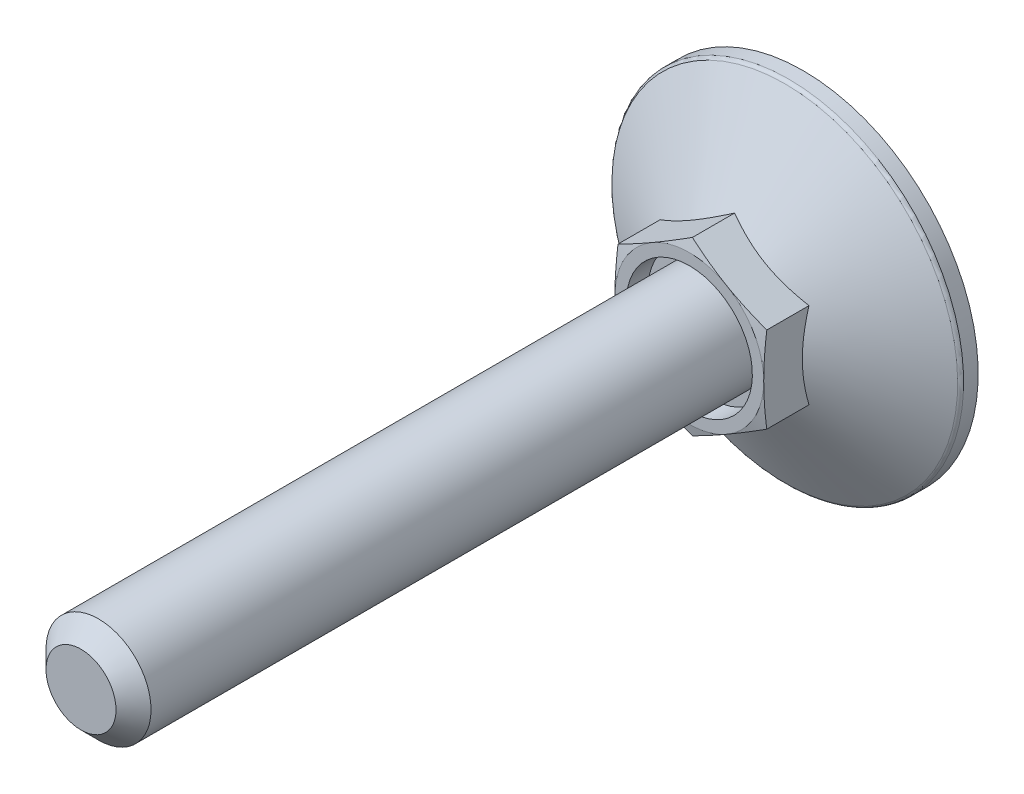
ISO-10303-21;
HEADER;
FILE_DESCRIPTION(('STEP AP214'),'2;1');
FILE_NAME('part.step','',(''),(''),'','','');
FILE_SCHEMA(('AUTOMOTIVE_DESIGN { 1 0 10303 214 1 1 1 1 }'));
ENDSEC;
DATA;
#1=APPLICATION_CONTEXT('core data for automotive mechanical design processes');
#2=APPLICATION_PROTOCOL_DEFINITION('international standard','automotive_design',2000,#1);
#3=PRODUCT_CONTEXT('',#1,'mechanical');
#4=PRODUCT('Part','Part','',(#3));
#5=PRODUCT_RELATED_PRODUCT_CATEGORY('part','',(#4));
#6=PRODUCT_DEFINITION_FORMATION('','',#4);
#7=PRODUCT_DEFINITION_CONTEXT('part definition',#1,'design');
#8=PRODUCT_DEFINITION('design','',#6,#7);
#9=PRODUCT_DEFINITION_SHAPE('','',#8);
#10=(LENGTH_UNIT() NAMED_UNIT(*) SI_UNIT(.MILLI.,.METRE.));
#11=(NAMED_UNIT(*) PLANE_ANGLE_UNIT() SI_UNIT($,.RADIAN.));
#12=(NAMED_UNIT(*) SI_UNIT($,.STERADIAN.) SOLID_ANGLE_UNIT());
#13=UNCERTAINTY_MEASURE_WITH_UNIT(LENGTH_MEASURE(1.E-05),#10,'distance_accuracy_value','');
#14=(GEOMETRIC_REPRESENTATION_CONTEXT(3) GLOBAL_UNCERTAINTY_ASSIGNED_CONTEXT((#13)) GLOBAL_UNIT_ASSIGNED_CONTEXT((#10,
#11,#12)) REPRESENTATION_CONTEXT('',''));
#15=CARTESIAN_POINT('',(0.,0.,0.));
#16=DIRECTION('',(0.,0.,1.));
#17=DIRECTION('',(1.,0.,0.));
#18=AXIS2_PLACEMENT_3D('',#15,#16,#17);
#19=CARTESIAN_POINT('',(0.,0.,10.525));
#20=DIRECTION('',(0.,0.,-1.));
#21=DIRECTION('',(0.,1.,0.));
#22=AXIS2_PLACEMENT_3D('',#19,#20,#21);
#23=PLANE('',#22);
#24=CARTESIAN_POINT('',(0.,0.,10.525));
#25=DIRECTION('',(0.,0.,-1.));
#26=DIRECTION('',(0.,1.,0.));
#27=AXIS2_PLACEMENT_3D('',#24,#25,#26);
#28=CIRCLE('',#27,7.2);
#29=CARTESIAN_POINT('',(0.,7.2,10.525));
#30=VERTEX_POINT('',#29);
#31=EDGE_CURVE('E108',#30,#30,#28,.T.);
#32=ORIENTED_EDGE('',*,*,#31,.F.);
#33=EDGE_LOOP('',(#32));
#34=FACE_BOUND('',#33,.T.);
#35=CARTESIAN_POINT('',(0.,0.,10.525));
#36=DIRECTION('',(0.,0.,-1.));
#37=DIRECTION('',(0.,1.,0.));
#38=AXIS2_PLACEMENT_3D('',#35,#36,#37);
#39=CIRCLE('',#38,6.);
#40=CARTESIAN_POINT('',(0.,6.,10.525));
#41=VERTEX_POINT('',#40);
#42=EDGE_CURVE('E260',#41,#41,#39,.F.);
#43=ORIENTED_EDGE('',*,*,#42,.F.);
#44=EDGE_LOOP('',(#43));
#45=FACE_BOUND('',#44,.T.);
#46=ADVANCED_FACE('F14',(#34,#45),#23,.F.);
#47=CARTESIAN_POINT('',(0.,9.81495457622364,99.));
#48=DIRECTION('',(0.5,-0.866025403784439,0.));
#49=DIRECTION('',(0.866025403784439,0.5,0.));
#50=AXIS2_PLACEMENT_3D('',#47,#48,#49);
#51=PLANE('',#50);
#52=CARTESIAN_POINT('',(-8.5002,4.90736181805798,7.83027204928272));
#53=CARTESIAN_POINT('',(-8.31336077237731,5.01523349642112,7.89254195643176));
#54=CARTESIAN_POINT('',(-8.1258249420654,5.1235073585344,7.95198579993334));
#55=CARTESIAN_POINT('',(-7.74923024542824,5.34093440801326,8.06444298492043));
#56=CARTESIAN_POINT('',(-7.56017075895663,5.45008795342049,8.1174535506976));
#57=CARTESIAN_POINT('',(-6.9899652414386,5.77929626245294,8.26579470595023));
#58=CARTESIAN_POINT('',(-6.60656835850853,6.00065055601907,8.3501691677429));
#59=CARTESIAN_POINT('',(-6.03282233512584,6.33190297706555,8.44910807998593));
#60=CARTESIAN_POINT('',(-5.84418723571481,6.44081150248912,8.47729289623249));
#61=CARTESIAN_POINT('',(-5.46606397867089,6.65912106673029,8.52455401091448));
#62=CARTESIAN_POINT('',(-5.27657589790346,6.76852206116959,8.54363111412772));
#63=CARTESIAN_POINT('',(-4.8972734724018,6.98751241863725,8.57219332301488));
#64=CARTESIAN_POINT('',(-4.7074597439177,7.09710142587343,8.58168931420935));
#65=CARTESIAN_POINT('',(-4.32765694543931,7.3163806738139,8.59088571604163));
#66=CARTESIAN_POINT('',(-4.13766788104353,7.42607091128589,8.59058642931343));
#67=CARTESIAN_POINT('',(-3.78247698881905,7.63114046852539,8.58087362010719));
#68=CARTESIAN_POINT('',(-3.6172500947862,7.72653426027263,8.57264492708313));
#69=CARTESIAN_POINT('',(-3.28718328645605,7.9170984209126,8.54893885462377));
#70=CARTESIAN_POINT('',(-3.12234339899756,8.01226877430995,8.53346098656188));
#71=CARTESIAN_POINT('',(-2.62846189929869,8.29741139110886,8.47651947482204));
#72=CARTESIAN_POINT('',(-2.30029449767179,8.48687892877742,8.42455503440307));
#73=CARTESIAN_POINT('',(-1.64047857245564,8.86782383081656,8.29464315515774));
#74=CARTESIAN_POINT('',(-1.30891425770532,9.05925257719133,8.21614502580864));
#75=CARTESIAN_POINT('',(-0.650730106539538,9.43925537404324,8.03798675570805));
#76=CARTESIAN_POINT('',(-0.324101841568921,9.62783429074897,7.93836845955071));
#77=CARTESIAN_POINT('',(0.000199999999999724,9.81507004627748,7.83027204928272));
#78=B_SPLINE_CURVE_WITH_KNOTS('',3,(#52,#53,#54,#55,#56,#57,#58,#59,#60,#61,#62,#63,#64,#65,#66,
#67,#68,#69,#70,#71,#72,#73,#74,#75,#76,#77),.UNSPECIFIED.,.F.,.F.,(4,2,2,2,2,2,2,2,2,2,2,2,4),
(0.,0.673596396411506,1.34748239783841,2.69805431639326,3.356799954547,4.01548737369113,
4.67342558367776,5.33134346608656,5.90409556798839,6.47688628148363,7.62328361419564,
8.79510569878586,9.9646274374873),.UNSPECIFIED.);
#79=CARTESIAN_POINT('',(-8.5,4.90747728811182,7.83033871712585));
#80=VERTEX_POINT('',#79);
#81=CARTESIAN_POINT('',(0.,9.81495457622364,7.83033871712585));
#82=VERTEX_POINT('',#81);
#83=EDGE_CURVE('E97',#80,#82,#78,.T.);
#84=ORIENTED_EDGE('',*,*,#83,.F.);
#85=DIRECTION('',(0.,0.,-1.));
#86=VECTOR('',#85,1.);
#87=CARTESIAN_POINT('',(-8.5,4.90747728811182,99.));
#88=LINE('',#87,#86);
#89=CARTESIAN_POINT('',(-8.5,4.90747728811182,12.6476589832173));
#90=VERTEX_POINT('',#89);
#91=EDGE_CURVE('E86',#90,#80,#88,.T.);
#92=ORIENTED_EDGE('',*,*,#91,.F.);
#93=CARTESIAN_POINT('',(0.000200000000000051,9.81507004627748,12.6476280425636));
#94=CARTESIAN_POINT('',(-0.352800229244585,9.61126526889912,12.7022599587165));
#95=CARTESIAN_POINT('',(-0.706440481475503,9.40709097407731,12.7518566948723));
#96=CARTESIAN_POINT('',(-1.41496987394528,8.99802133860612,12.8389934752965));
#97=CARTESIAN_POINT('',(-1.76985946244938,8.79312573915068,12.8765286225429));
#98=CARTESIAN_POINT('',(-2.47873586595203,8.38385575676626,12.9373509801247));
#99=CARTESIAN_POINT('',(-2.83271788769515,8.17948414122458,12.9607107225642));
#100=CARTESIAN_POINT('',(-3.5411333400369,7.77048028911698,12.9920337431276));
#101=CARTESIAN_POINT('',(-3.89556667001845,7.56584811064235,13.));
#102=CARTESIAN_POINT('',(-4.60443332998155,7.15658375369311,13.));
#103=CARTESIAN_POINT('',(-4.9588666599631,6.95195157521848,12.9920337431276));
#104=CARTESIAN_POINT('',(-5.66728211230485,6.54294772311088,12.9607107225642));
#105=CARTESIAN_POINT('',(-6.02126413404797,6.33857610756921,12.9373509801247));
#106=CARTESIAN_POINT('',(-6.73014053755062,5.92930612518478,12.8765286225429));
#107=CARTESIAN_POINT('',(-7.08503012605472,5.72441052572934,12.8389934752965));
#108=CARTESIAN_POINT('',(-7.7935595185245,5.31534089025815,12.7518566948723));
#109=CARTESIAN_POINT('',(-8.14719977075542,5.11116659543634,12.7022599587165));
#110=CARTESIAN_POINT('',(-8.5002,4.90736181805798,12.6476280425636));
#111=B_SPLINE_CURVE_WITH_KNOTS('',3,(#93,#94,#95,#96,#97,#98,#99,#100,#101,#102,#103,#104,#105,
#106,#107,#108,#109,#110),.UNSPECIFIED.,.F.,.F.,(4,2,2,2,2,2,2,2,4),(0.,1.23382789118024,
2.46815608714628,3.69611406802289,4.92383440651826,6.15155474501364,7.37951272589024,
8.61384092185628,9.84766881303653),.UNSPECIFIED.);
#112=CARTESIAN_POINT('',(-4.25,7.36121593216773,13.));
#113=VERTEX_POINT('',#112);
#114=EDGE_CURVE('E187',#113,#90,#111,.T.);
#115=ORIENTED_EDGE('',*,*,#114,.F.);
#116=CARTESIAN_POINT('',(0.,9.81495457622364,12.6476589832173));
#117=VERTEX_POINT('',#116);
#118=EDGE_CURVE('E319',#117,#113,#111,.T.);
#119=ORIENTED_EDGE('',*,*,#118,.F.);
#120=DIRECTION('',(0.,0.,-1.));
#121=VECTOR('',#120,1.);
#122=CARTESIAN_POINT('',(0.,9.81495457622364,99.));
#123=LINE('',#122,#121);
#124=EDGE_CURVE('E101',#117,#82,#123,.T.);
#125=ORIENTED_EDGE('',*,*,#124,.T.);
#126=EDGE_LOOP('',(#84,#92,#115,#119,#125));
#127=FACE_BOUND('',#126,.T.);
#128=ADVANCED_FACE('F100',(#127),#51,.F.);
#129=CARTESIAN_POINT('',(8.5,4.90747728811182,99.));
#130=DIRECTION('',(-0.5,-0.866025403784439,0.));
#131=DIRECTION('',(0.866025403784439,-0.5,0.));
#132=AXIS2_PLACEMENT_3D('',#129,#130,#131);
#133=PLANE('',#132);
#134=CARTESIAN_POINT('',(-0.0002,9.81507004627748,7.83027204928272));
#135=CARTESIAN_POINT('',(0.186639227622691,9.70719836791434,7.89254195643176));
#136=CARTESIAN_POINT('',(0.374175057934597,9.59892450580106,7.95198579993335));
#137=CARTESIAN_POINT('',(0.750769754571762,9.3814974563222,8.06444298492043));
#138=CARTESIAN_POINT('',(0.939829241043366,9.27234391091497,8.1174535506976));
#139=CARTESIAN_POINT('',(1.5100347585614,8.94313560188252,8.26579470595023));
#140=CARTESIAN_POINT('',(1.89343164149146,8.72178130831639,8.3501691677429));
#141=CARTESIAN_POINT('',(2.46717766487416,8.39052888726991,8.44910807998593));
#142=CARTESIAN_POINT('',(2.65581276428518,8.28162036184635,8.47729289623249));
#143=CARTESIAN_POINT('',(3.03393602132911,8.06331079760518,8.52455401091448));
#144=CARTESIAN_POINT('',(3.22342410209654,7.95390980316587,8.54363111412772));
#145=CARTESIAN_POINT('',(3.6027265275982,7.73491944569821,8.57219332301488));
#146=CARTESIAN_POINT('',(3.79254025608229,7.62533043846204,8.58168931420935));
#147=CARTESIAN_POINT('',(4.17234305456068,7.40605119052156,8.59088571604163));
#148=CARTESIAN_POINT('',(4.36233211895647,7.29636095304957,8.59058642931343));
#149=CARTESIAN_POINT('',(4.71752301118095,7.09129139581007,8.58087362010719));
#150=CARTESIAN_POINT('',(4.8827499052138,6.99589760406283,8.57264492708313));
#151=CARTESIAN_POINT('',(5.21281671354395,6.80533344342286,8.54893885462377));
#152=CARTESIAN_POINT('',(5.37765660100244,6.71016309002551,8.53346098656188));
#153=CARTESIAN_POINT('',(5.87153810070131,6.42502047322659,8.47651947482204));
#154=CARTESIAN_POINT('',(6.19970550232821,6.23555293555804,8.42455503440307));
#155=CARTESIAN_POINT('',(6.85952142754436,5.8546080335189,8.29464315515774));
#156=CARTESIAN_POINT('',(7.19108574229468,5.66317928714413,8.21614502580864));
#157=CARTESIAN_POINT('',(7.84926989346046,5.28317649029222,8.03798675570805));
#158=CARTESIAN_POINT('',(8.17589815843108,5.09459757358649,7.93836845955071));
#159=CARTESIAN_POINT('',(8.5002,4.90736181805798,7.83027204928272));
#160=B_SPLINE_CURVE_WITH_KNOTS('',3,(#134,#135,#136,#137,#138,#139,#140,#141,#142,#143,#144,
#145,#146,#147,#148,#149,#150,#151,#152,#153,#154,#155,#156,#157,#158,#159),.UNSPECIFIED.,.F.,
.F.,(4,2,2,2,2,2,2,2,2,2,2,2,4),(0.,0.673596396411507,1.34748239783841,2.69805431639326,
3.35679995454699,4.01548737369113,4.67342558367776,5.33134346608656,5.90409556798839,
6.47688628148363,7.62328361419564,8.79510569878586,9.9646274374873),.UNSPECIFIED.);
#161=CARTESIAN_POINT('',(8.5,4.90747728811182,7.83033871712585));
#162=VERTEX_POINT('',#161);
#163=EDGE_CURVE('E29',#82,#162,#160,.T.);
#164=ORIENTED_EDGE('',*,*,#163,.F.);
#165=ORIENTED_EDGE('',*,*,#124,.F.);
#166=CARTESIAN_POINT('',(8.5002,4.90736181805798,12.6476280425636));
#167=CARTESIAN_POINT('',(8.14719977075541,5.11116659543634,12.7022599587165));
#168=CARTESIAN_POINT('',(7.7935595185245,5.31534089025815,12.7518566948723));
#169=CARTESIAN_POINT('',(7.08503012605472,5.72441052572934,12.8389934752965));
#170=CARTESIAN_POINT('',(6.73014053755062,5.92930612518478,12.8765286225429));
#171=CARTESIAN_POINT('',(6.02126413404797,6.33857610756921,12.9373509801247));
#172=CARTESIAN_POINT('',(5.66728211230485,6.54294772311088,12.9607107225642));
#173=CARTESIAN_POINT('',(4.9588666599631,6.95195157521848,12.9920337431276));
#174=CARTESIAN_POINT('',(4.60443332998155,7.15658375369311,13.));
#175=CARTESIAN_POINT('',(3.89556667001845,7.56584811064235,13.));
#176=CARTESIAN_POINT('',(3.5411333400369,7.77048028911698,12.9920337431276));
#177=CARTESIAN_POINT('',(2.83271788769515,8.17948414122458,12.9607107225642));
#178=CARTESIAN_POINT('',(2.47873586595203,8.38385575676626,12.9373509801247));
#179=CARTESIAN_POINT('',(1.76985946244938,8.79312573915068,12.8765286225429));
#180=CARTESIAN_POINT('',(1.41496987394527,8.99802133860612,12.8389934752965));
#181=CARTESIAN_POINT('',(0.7064404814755,9.40709097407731,12.7518566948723));
#182=CARTESIAN_POINT('',(0.352800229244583,9.61126526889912,12.7022599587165));
#183=CARTESIAN_POINT('',(-0.000200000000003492,9.81507004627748,12.6476280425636));
#184=B_SPLINE_CURVE_WITH_KNOTS('',3,(#166,#167,#168,#169,#170,#171,#172,#173,#174,#175,#176,
#177,#178,#179,#180,#181,#182,#183),.UNSPECIFIED.,.F.,.F.,(4,2,2,2,2,2,2,2,4),(0.,
1.23382789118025,2.46815608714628,3.69611406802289,4.92383440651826,6.15155474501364,
7.37951272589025,8.61384092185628,9.84766881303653),.UNSPECIFIED.);
#185=CARTESIAN_POINT('',(4.25,7.36121593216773,13.));
#186=VERTEX_POINT('',#185);
#187=EDGE_CURVE('E178',#186,#117,#184,.T.);
#188=ORIENTED_EDGE('',*,*,#187,.F.);
#189=CARTESIAN_POINT('',(8.5,4.90747728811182,12.6476589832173));
#190=VERTEX_POINT('',#189);
#191=EDGE_CURVE('E185',#190,#186,#184,.T.);
#192=ORIENTED_EDGE('',*,*,#191,.F.);
#193=DIRECTION('',(0.,0.,-1.));
#194=VECTOR('',#193,1.);
#195=CARTESIAN_POINT('',(8.5,4.90747728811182,99.));
#196=LINE('',#195,#194);
#197=EDGE_CURVE('E217',#190,#162,#196,.T.);
#198=ORIENTED_EDGE('',*,*,#197,.T.);
#199=EDGE_LOOP('',(#164,#165,#188,#192,#198));
#200=FACE_BOUND('',#199,.T.);
#201=ADVANCED_FACE('F193',(#200),#133,.F.);
#202=CARTESIAN_POINT('',(8.5,-4.90747728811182,99.));
#203=DIRECTION('',(-1.,0.,0.));
#204=DIRECTION('',(0.,-1.,0.));
#205=AXIS2_PLACEMENT_3D('',#202,#203,#204);
#206=PLANE('',#205);
#207=CARTESIAN_POINT('',(8.5,12.8220542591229,4.61528116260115));
#208=CARTESIAN_POINT('',(8.5,12.4534155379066,4.79262377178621));
#209=CARTESIAN_POINT('',(8.5,12.0838902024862,4.96815716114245));
#210=CARTESIAN_POINT('',(8.5,11.3425927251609,5.31457894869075));
#211=CARTESIAN_POINT('',(8.5,10.9708202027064,5.48546653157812));
#212=CARTESIAN_POINT('',(8.5,10.2224625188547,5.82250763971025));
#213=CARTESIAN_POINT('',(8.5,9.84586188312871,5.98862693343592));
#214=CARTESIAN_POINT('',(8.5,9.08953299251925,6.31355867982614));
#215=CARTESIAN_POINT('',(8.5,8.70980489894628,6.47237150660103));
#216=CARTESIAN_POINT('',(8.5,7.93635853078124,6.78489169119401));
#217=CARTESIAN_POINT('',(8.5,7.5425381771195,6.93834789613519));
#218=CARTESIAN_POINT('',(8.5,6.75016193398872,7.23275009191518));
#219=CARTESIAN_POINT('',(8.5,6.35160550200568,7.37369463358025));
#220=CARTESIAN_POINT('',(8.5,5.54998630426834,7.63911020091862));
#221=CARTESIAN_POINT('',(8.5,5.14693580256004,7.76361784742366));
#222=CARTESIAN_POINT('',(8.5,4.33508769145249,7.99193558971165));
#223=CARTESIAN_POINT('',(8.5,3.92629204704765,8.09575258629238));
#224=CARTESIAN_POINT('',(8.5,3.10458766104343,8.27700176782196));
#225=CARTESIAN_POINT('',(8.5,2.69170444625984,8.35454642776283));
#226=CARTESIAN_POINT('',(8.5,2.06892742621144,8.44757828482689));
#227=CARTESIAN_POINT('',(8.5,1.86074253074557,8.47470931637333));
#228=CARTESIAN_POINT('',(8.5,1.44346514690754,8.52067173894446));
#229=CARTESIAN_POINT('',(8.5,1.23437274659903,8.5395039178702));
#230=CARTESIAN_POINT('',(8.5,0.818123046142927,8.5682751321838));
#231=CARTESIAN_POINT('',(8.5,0.6109730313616,8.57831925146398));
#232=CARTESIAN_POINT('',(8.5,0.196434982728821,8.58967320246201));
#233=CARTESIAN_POINT('',(8.5,-0.0109530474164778,8.59098316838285));
#234=CARTESIAN_POINT('',(8.5,-0.425608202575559,8.58483724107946));
#235=CARTESIAN_POINT('',(8.5,-0.632875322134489,8.57738097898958));
#236=CARTESIAN_POINT('',(8.5,-1.04692490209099,8.55387613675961));
#237=CARTESIAN_POINT('',(8.5,-1.25370733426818,8.5378270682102));
#238=CARTESIAN_POINT('',(8.5,-1.76172684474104,8.48816674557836));
#239=CARTESIAN_POINT('',(8.5,-2.06251418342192,8.44986872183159));
#240=CARTESIAN_POINT('',(8.5,-2.66160170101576,8.35726697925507));
#241=CARTESIAN_POINT('',(8.5,-2.95990148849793,8.30296078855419));
#242=CARTESIAN_POINT('',(8.5,-3.85084347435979,8.11893322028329));
#243=CARTESIAN_POINT('',(8.5,-4.4391769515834,7.96814146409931));
#244=CARTESIAN_POINT('',(8.5,-5.31919968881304,7.70971639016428));
#245=CARTESIAN_POINT('',(8.5,-5.61551051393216,7.61694416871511));
#246=CARTESIAN_POINT('',(8.5,-6.20524874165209,7.4225646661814));
#247=CARTESIAN_POINT('',(8.5,-6.4986761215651,7.3209573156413));
#248=CARTESIAN_POINT('',(8.5,-7.08276471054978,7.11046965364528));
#249=CARTESIAN_POINT('',(8.5,-7.37342689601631,7.0015920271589));
#250=CARTESIAN_POINT('',(8.5,-7.95239195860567,6.77777126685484));
#251=CARTESIAN_POINT('',(8.5,-8.2406948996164,6.66282829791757));
#252=CARTESIAN_POINT('',(8.5,-8.80562449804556,6.43181846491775));
#253=CARTESIAN_POINT('',(8.5,-9.08231928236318,6.31591764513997));
#254=CARTESIAN_POINT('',(8.5,-9.63401072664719,6.0801365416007));
#255=CARTESIAN_POINT('',(8.5,-9.90900735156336,5.96025617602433));
#256=CARTESIAN_POINT('',(8.5,-10.7318217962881,5.59557173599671));
#257=CARTESIAN_POINT('',(8.5,-11.2774137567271,5.34574521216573));
#258=CARTESIAN_POINT('',(8.5,-12.3642460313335,4.83628492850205));
#259=CARTESIAN_POINT('',(8.5,-12.905484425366,4.57664710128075));
#260=CARTESIAN_POINT('',(8.5,-13.9843891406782,4.05013469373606));
#261=CARTESIAN_POINT('',(8.5,-14.5220556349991,3.78326046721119));
#262=CARTESIAN_POINT('',(8.5,-15.5954930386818,3.24355438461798));
#263=CARTESIAN_POINT('',(8.5,-16.1312593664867,2.97071343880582));
#264=CARTESIAN_POINT('',(8.5,-17.2005865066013,2.4207361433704));
#265=CARTESIAN_POINT('',(8.5,-17.7341472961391,2.14359974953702));
#266=CARTESIAN_POINT('',(8.5,-18.7993643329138,1.58600707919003));
#267=CARTESIAN_POINT('',(8.5,-19.3310210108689,1.30555162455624));
#268=CARTESIAN_POINT('',(8.5,-20.3928917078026,0.741921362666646));
#269=CARTESIAN_POINT('',(8.5,-20.9231057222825,0.458746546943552));
#270=CARTESIAN_POINT('',(8.5,-22.3874236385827,-0.32722037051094));
#271=CARTESIAN_POINT('',(8.5,-23.3202800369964,-0.83233607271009));
#272=CARTESIAN_POINT('',(8.5,-25.1833983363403,-1.84747335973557));
#273=CARTESIAN_POINT('',(8.5,-26.1136600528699,-2.35749528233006));
#274=CARTESIAN_POINT('',(8.5,-27.9692131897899,-3.37950461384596));
#275=CARTESIAN_POINT('',(8.5,-28.8945109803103,-3.89148046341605));
#276=CARTESIAN_POINT('',(8.5,-30.2812847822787,-4.66146611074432));
#277=CARTESIAN_POINT('',(8.5,-30.7433285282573,-4.91845451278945));
#278=CARTESIAN_POINT('',(8.5,-31.6670795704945,-5.43303439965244));
#279=CARTESIAN_POINT('',(8.5,-32.1287868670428,-5.69062588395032));
#280=CARTESIAN_POINT('',(8.5,-32.5903473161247,-5.94848028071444));
#281=B_SPLINE_CURVE_WITH_KNOTS('',3,(#207,#208,#209,#210,#211,#212,#213,#214,#215,#216,#217,
#218,#219,#220,#221,#222,#223,#224,#225,#226,#227,#228,#229,#230,#231,#232,#233,#234,#235,#236,
#237,#238,#239,#240,#241,#242,#243,#244,#245,#246,#247,#248,#249,#250,#251,#252,#253,#254,#255,
#256,#257,#258,#259,#260,#261,#262,#263,#264,#265,#266,#267,#268,#269,#270,#271,#272,#273,#274,
#275,#276,#277,#278,#279,#280),.UNSPECIFIED.,.F.,.F.,(4,2,2,2,2,2,2,2,2,2,2,2,2,2,2,2,2,2,2,2,2,
2,2,2,2,2,2,2,2,2,2,2,2,2,2,2,4),(0.,1.22725127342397,2.45471654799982,3.68948778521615,
4.92419572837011,6.19201746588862,7.45998585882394,8.72507978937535,9.98975107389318,
11.2489376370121,11.878634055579,12.5082706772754,13.1302712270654,13.7522622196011,
14.3742793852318,14.9963319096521,15.9054589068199,16.814726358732,18.6343169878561,
19.5657329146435,20.4971561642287,21.4282373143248,22.3592931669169,23.259222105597,
24.1591695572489,25.9592281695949,27.7600413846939,29.5607667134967,31.3644583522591,
33.1681685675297,34.9714411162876,36.7747192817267,39.9571898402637,43.1398810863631,
46.3123590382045,47.8984694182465,49.4845784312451),.UNSPECIFIED.);
#282=CARTESIAN_POINT('',(8.5,-4.90747728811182,7.83033871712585));
#283=VERTEX_POINT('',#282);
#284=EDGE_CURVE('E37',#162,#283,#281,.T.);
#285=ORIENTED_EDGE('',*,*,#284,.F.);
#286=ORIENTED_EDGE('',*,*,#197,.F.);
#287=CARTESIAN_POINT('',(8.5,12.9820891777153,11.1197370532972));
#288=CARTESIAN_POINT('',(8.5,12.5964686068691,11.2061594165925));
#289=CARTESIAN_POINT('',(8.5,12.2106068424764,11.2915248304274));
#290=CARTESIAN_POINT('',(8.5,11.4382824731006,11.4595712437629));
#291=CARTESIAN_POINT('',(8.5,11.0518198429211,11.5422521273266));
#292=CARTESIAN_POINT('',(8.5,10.2778290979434,11.7044309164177));
#293=CARTESIAN_POINT('',(8.5,9.89030030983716,11.7839256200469));
#294=CARTESIAN_POINT('',(8.5,9.11443612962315,11.9388739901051));
#295=CARTESIAN_POINT('',(8.5,8.72610074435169,12.0143276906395));
#296=CARTESIAN_POINT('',(8.5,7.95158013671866,12.159650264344));
#297=CARTESIAN_POINT('',(8.5,7.56540239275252,12.2295587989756));
#298=CARTESIAN_POINT('',(8.5,6.79199352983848,12.3632725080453));
#299=CARTESIAN_POINT('',(8.5,6.40476243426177,12.4270778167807));
#300=CARTESIAN_POINT('',(8.5,5.62917169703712,12.54714843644));
#301=CARTESIAN_POINT('',(8.5,5.24081220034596,12.6034146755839));
#302=CARTESIAN_POINT('',(8.5,4.46285737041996,12.70674908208));
#303=CARTESIAN_POINT('',(8.5,4.07326203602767,12.7538172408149));
#304=CARTESIAN_POINT('',(8.5,3.28844017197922,12.8374226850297));
#305=CARTESIAN_POINT('',(8.5,2.89320002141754,12.8738340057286));
#306=CARTESIAN_POINT('',(8.5,2.10172608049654,12.9336139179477));
#307=CARTESIAN_POINT('',(8.5,1.70549231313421,12.9569828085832));
#308=CARTESIAN_POINT('',(8.5,0.912605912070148,12.9893148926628));
#309=CARTESIAN_POINT('',(8.5,0.515953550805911,12.9982846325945));
#310=CARTESIAN_POINT('',(8.5,-0.27740821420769,13.0012669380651));
#311=CARTESIAN_POINT('',(8.5,-0.674117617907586,12.9952795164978));
#312=CARTESIAN_POINT('',(8.5,-1.46847963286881,12.9686842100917));
#313=CARTESIAN_POINT('',(8.5,-1.86613043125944,12.9480232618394));
#314=CARTESIAN_POINT('',(8.5,-2.66049684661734,12.8932602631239));
#315=CARTESIAN_POINT('',(8.5,-3.05721244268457,12.8591579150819));
#316=CARTESIAN_POINT('',(8.5,-3.84970511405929,12.7792347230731));
#317=CARTESIAN_POINT('',(8.5,-4.24548140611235,12.7334062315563));
#318=CARTESIAN_POINT('',(8.5,-5.03576028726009,12.6319377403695));
#319=CARTESIAN_POINT('',(8.5,-5.43026287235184,12.5762977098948));
#320=CARTESIAN_POINT('',(8.5,-6.19195385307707,12.4609360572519));
#321=CARTESIAN_POINT('',(8.5,-6.55922094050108,12.4017287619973));
#322=CARTESIAN_POINT('',(8.5,-7.29278719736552,12.2775674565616));
#323=CARTESIAN_POINT('',(8.5,-7.65908634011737,12.2126132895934));
#324=CARTESIAN_POINT('',(8.5,-8.39085027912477,12.078008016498));
#325=CARTESIAN_POINT('',(8.5,-8.75631499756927,12.0083564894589));
#326=CARTESIAN_POINT('',(8.5,-9.48649515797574,11.8652200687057));
#327=CARTESIAN_POINT('',(8.5,-9.85121059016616,11.7917351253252));
#328=CARTESIAN_POINT('',(8.5,-10.5800753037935,11.6416087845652));
#329=CARTESIAN_POINT('',(8.5,-10.944224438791,11.5649666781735));
#330=CARTESIAN_POINT('',(8.5,-11.6719684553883,11.4090909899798));
#331=CARTESIAN_POINT('',(8.5,-12.0355633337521,11.3298573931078));
#332=CARTESIAN_POINT('',(8.5,-13.1255915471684,11.0889686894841));
#333=CARTESIAN_POINT('',(8.5,-13.8513178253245,10.9241153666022));
#334=CARTESIAN_POINT('',(8.5,-15.2942598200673,10.590109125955));
#335=CARTESIAN_POINT('',(8.5,-16.0114890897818,10.421014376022));
#336=CARTESIAN_POINT('',(8.5,-17.4449475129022,10.0785875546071));
#337=CARTESIAN_POINT('',(8.5,-18.1611766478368,9.9052554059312));
#338=CARTESIAN_POINT('',(8.5,-19.5919856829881,9.55567998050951));
#339=CARTESIAN_POINT('',(8.5,-20.306566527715,9.37944056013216));
#340=CARTESIAN_POINT('',(8.5,-21.7351057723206,9.02455520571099));
#341=CARTESIAN_POINT('',(8.5,-22.4490641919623,8.84590935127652));
#342=CARTESIAN_POINT('',(8.5,-23.1628057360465,8.66641079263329));
#343=B_SPLINE_CURVE_WITH_KNOTS('',3,(#287,#288,#289,#290,#291,#292,#293,#294,#295,#296,#297,
#298,#299,#300,#301,#302,#303,#304,#305,#306,#307,#308,#309,#310,#311,#312,#313,#314,#315,#316,
#317,#318,#319,#320,#321,#322,#323,#324,#325,#326,#327,#328,#329,#330,#331,#332,#333,#334,#335,
#336,#337,#338,#339,#340,#341,#342),.UNSPECIFIED.,.F.,.F.,(4,2,2,2,2,2,2,2,2,2,2,2,2,2,2,2,2,2,
2,2,2,2,2,2,2,2,2,4),(0.,1.18556310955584,2.37117735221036,3.5579546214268,4.74472187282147,
5.92204594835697,7.09934411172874,8.27649719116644,9.45365137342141,10.6442044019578,
11.8347301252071,13.0247144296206,14.2146977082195,15.4090063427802,16.6033414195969,
17.7984574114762,18.9935771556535,20.1095500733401,21.2255534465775,22.3416569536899,
23.4577749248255,24.5741449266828,25.6905214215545,27.9231231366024,30.1337863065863,
32.3444897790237,34.5524651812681,36.7603677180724),.UNSPECIFIED.);
#344=CARTESIAN_POINT('',(8.5,0.,13.));
#345=VERTEX_POINT('',#344);
#346=EDGE_CURVE('E171',#345,#190,#343,.F.);
#347=ORIENTED_EDGE('',*,*,#346,.F.);
#348=CARTESIAN_POINT('',(8.5,-4.90747728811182,12.6476589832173));
#349=VERTEX_POINT('',#348);
#350=EDGE_CURVE('E186',#349,#345,#343,.F.);
#351=ORIENTED_EDGE('',*,*,#350,.F.);
#352=DIRECTION('',(0.,0.,-1.));
#353=VECTOR('',#352,1.);
#354=CARTESIAN_POINT('',(8.5,-4.90747728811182,99.));
#355=LINE('',#354,#353);
#356=EDGE_CURVE('E219',#349,#283,#355,.T.);
#357=ORIENTED_EDGE('',*,*,#356,.T.);
#358=EDGE_LOOP('',(#285,#286,#347,#351,#357));
#359=FACE_BOUND('',#358,.T.);
#360=ADVANCED_FACE('F196',(#359),#206,.F.);
#361=CARTESIAN_POINT('',(0.,-9.81495457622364,99.));
#362=DIRECTION('',(-0.5,0.866025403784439,0.));
#363=DIRECTION('',(-0.866025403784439,-0.5,0.));
#364=AXIS2_PLACEMENT_3D('',#361,#362,#363);
#365=PLANE('',#364);
#366=CARTESIAN_POINT('',(8.5002,-4.90736181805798,7.83027204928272));
#367=CARTESIAN_POINT('',(8.31336077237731,-5.01523349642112,7.89254195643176));
#368=CARTESIAN_POINT('',(8.1258249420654,-5.1235073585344,7.95198579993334));
#369=CARTESIAN_POINT('',(7.74923024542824,-5.34093440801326,8.06444298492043));
#370=CARTESIAN_POINT('',(7.56017075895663,-5.45008795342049,8.1174535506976));
#371=CARTESIAN_POINT('',(6.9899652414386,-5.77929626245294,8.26579470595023));
#372=CARTESIAN_POINT('',(6.60656835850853,-6.00065055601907,8.3501691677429));
#373=CARTESIAN_POINT('',(6.03282233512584,-6.33190297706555,8.44910807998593));
#374=CARTESIAN_POINT('',(5.84418723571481,-6.44081150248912,8.47729289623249));
#375=CARTESIAN_POINT('',(5.46606397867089,-6.65912106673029,8.52455401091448));
#376=CARTESIAN_POINT('',(5.27657589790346,-6.76852206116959,8.54363111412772));
#377=CARTESIAN_POINT('',(4.8972734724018,-6.98751241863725,8.57219332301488));
#378=CARTESIAN_POINT('',(4.7074597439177,-7.09710142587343,8.58168931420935));
#379=CARTESIAN_POINT('',(4.32765694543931,-7.3163806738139,8.59088571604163));
#380=CARTESIAN_POINT('',(4.13766788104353,-7.42607091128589,8.59058642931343));
#381=CARTESIAN_POINT('',(3.78247698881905,-7.63114046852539,8.58087362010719));
#382=CARTESIAN_POINT('',(3.6172500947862,-7.72653426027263,8.57264492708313));
#383=CARTESIAN_POINT('',(3.28718328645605,-7.9170984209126,8.54893885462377));
#384=CARTESIAN_POINT('',(3.12234339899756,-8.01226877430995,8.53346098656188));
#385=CARTESIAN_POINT('',(2.62846189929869,-8.29741139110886,8.47651947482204));
#386=CARTESIAN_POINT('',(2.30029449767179,-8.48687892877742,8.42455503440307));
#387=CARTESIAN_POINT('',(1.64047857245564,-8.86782383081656,8.29464315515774));
#388=CARTESIAN_POINT('',(1.30891425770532,-9.05925257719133,8.21614502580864));
#389=CARTESIAN_POINT('',(0.650730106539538,-9.43925537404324,8.03798675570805));
#390=CARTESIAN_POINT('',(0.324101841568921,-9.62783429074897,7.93836845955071));
#391=CARTESIAN_POINT('',(-0.000199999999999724,-9.81507004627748,7.83027204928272));
#392=B_SPLINE_CURVE_WITH_KNOTS('',3,(#366,#367,#368,#369,#370,#371,#372,#373,#374,#375,#376,
#377,#378,#379,#380,#381,#382,#383,#384,#385,#386,#387,#388,#389,#390,#391),.UNSPECIFIED.,.F.,
.F.,(4,2,2,2,2,2,2,2,2,2,2,2,4),(0.,0.673596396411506,1.34748239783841,2.69805431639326,
3.356799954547,4.01548737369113,4.67342558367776,5.33134346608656,5.90409556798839,
6.47688628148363,7.62328361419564,8.79510569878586,9.9646274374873),.UNSPECIFIED.);
#393=CARTESIAN_POINT('',(0.,-9.81495457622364,7.83033871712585));
#394=VERTEX_POINT('',#393);
#395=EDGE_CURVE('E277',#283,#394,#392,.T.);
#396=ORIENTED_EDGE('',*,*,#395,.F.);
#397=ORIENTED_EDGE('',*,*,#356,.F.);
#398=CARTESIAN_POINT('',(-0.000200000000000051,-9.81507004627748,12.6476280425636));
#399=CARTESIAN_POINT('',(0.352800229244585,-9.61126526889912,12.7022599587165));
#400=CARTESIAN_POINT('',(0.706440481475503,-9.40709097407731,12.7518566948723));
#401=CARTESIAN_POINT('',(1.41496987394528,-8.99802133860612,12.8389934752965));
#402=CARTESIAN_POINT('',(1.76985946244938,-8.79312573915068,12.8765286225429));
#403=CARTESIAN_POINT('',(2.47873586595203,-8.38385575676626,12.9373509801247));
#404=CARTESIAN_POINT('',(2.83271788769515,-8.17948414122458,12.9607107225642));
#405=CARTESIAN_POINT('',(3.5411333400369,-7.77048028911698,12.9920337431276));
#406=CARTESIAN_POINT('',(3.89556667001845,-7.56584811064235,13.));
#407=CARTESIAN_POINT('',(4.60443332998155,-7.15658375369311,13.));
#408=CARTESIAN_POINT('',(4.9588666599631,-6.95195157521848,12.9920337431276));
#409=CARTESIAN_POINT('',(5.66728211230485,-6.54294772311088,12.9607107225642));
#410=CARTESIAN_POINT('',(6.02126413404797,-6.33857610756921,12.9373509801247));
#411=CARTESIAN_POINT('',(6.73014053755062,-5.92930612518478,12.8765286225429));
#412=CARTESIAN_POINT('',(7.08503012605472,-5.72441052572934,12.8389934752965));
#413=CARTESIAN_POINT('',(7.7935595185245,-5.31534089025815,12.7518566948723));
#414=CARTESIAN_POINT('',(8.14719977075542,-5.11116659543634,12.7022599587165));
#415=CARTESIAN_POINT('',(8.5002,-4.90736181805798,12.6476280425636));
#416=B_SPLINE_CURVE_WITH_KNOTS('',3,(#398,#399,#400,#401,#402,#403,#404,#405,#406,#407,#408,
#409,#410,#411,#412,#413,#414,#415),.UNSPECIFIED.,.F.,.F.,(4,2,2,2,2,2,2,2,4),(0.,
1.23382789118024,2.46815608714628,3.69611406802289,4.92383440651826,6.15155474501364,
7.37951272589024,8.61384092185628,9.84766881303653),.UNSPECIFIED.);
#417=CARTESIAN_POINT('',(4.25,-7.36121593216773,13.));
#418=VERTEX_POINT('',#417);
#419=EDGE_CURVE('E165',#418,#349,#416,.T.);
#420=ORIENTED_EDGE('',*,*,#419,.F.);
#421=CARTESIAN_POINT('',(0.,-9.81495457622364,12.6476589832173));
#422=VERTEX_POINT('',#421);
#423=EDGE_CURVE('E300',#422,#418,#416,.T.);
#424=ORIENTED_EDGE('',*,*,#423,.F.);
#425=DIRECTION('',(0.,0.,-1.));
#426=VECTOR('',#425,1.);
#427=CARTESIAN_POINT('',(0.,-9.81495457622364,99.));
#428=LINE('',#427,#426);
#429=EDGE_CURVE('E221',#422,#394,#428,.T.);
#430=ORIENTED_EDGE('',*,*,#429,.T.);
#431=EDGE_LOOP('',(#396,#397,#420,#424,#430));
#432=FACE_BOUND('',#431,.T.);
#433=ADVANCED_FACE('F282',(#432),#365,.F.);
#434=CARTESIAN_POINT('',(-8.5,-4.90747728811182,99.));
#435=DIRECTION('',(0.5,0.866025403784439,0.));
#436=DIRECTION('',(-0.866025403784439,0.5,0.));
#437=AXIS2_PLACEMENT_3D('',#434,#435,#436);
#438=PLANE('',#437);
#439=CARTESIAN_POINT('',(0.0002,-9.81507004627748,7.83027204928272));
#440=CARTESIAN_POINT('',(-0.186639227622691,-9.70719836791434,7.89254195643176));
#441=CARTESIAN_POINT('',(-0.374175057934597,-9.59892450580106,7.95198579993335));
#442=CARTESIAN_POINT('',(-0.750769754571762,-9.3814974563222,8.06444298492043));
#443=CARTESIAN_POINT('',(-0.939829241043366,-9.27234391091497,8.1174535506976));
#444=CARTESIAN_POINT('',(-1.5100347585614,-8.94313560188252,8.26579470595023));
#445=CARTESIAN_POINT('',(-1.89343164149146,-8.72178130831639,8.3501691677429));
#446=CARTESIAN_POINT('',(-2.46717766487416,-8.39052888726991,8.44910807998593));
#447=CARTESIAN_POINT('',(-2.65581276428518,-8.28162036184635,8.47729289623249));
#448=CARTESIAN_POINT('',(-3.03393602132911,-8.06331079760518,8.52455401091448));
#449=CARTESIAN_POINT('',(-3.22342410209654,-7.95390980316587,8.54363111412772));
#450=CARTESIAN_POINT('',(-3.6027265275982,-7.73491944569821,8.57219332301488));
#451=CARTESIAN_POINT('',(-3.79254025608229,-7.62533043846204,8.58168931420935));
#452=CARTESIAN_POINT('',(-4.17234305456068,-7.40605119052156,8.59088571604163));
#453=CARTESIAN_POINT('',(-4.36233211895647,-7.29636095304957,8.59058642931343));
#454=CARTESIAN_POINT('',(-4.71752301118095,-7.09129139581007,8.58087362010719));
#455=CARTESIAN_POINT('',(-4.8827499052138,-6.99589760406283,8.57264492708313));
#456=CARTESIAN_POINT('',(-5.21281671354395,-6.80533344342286,8.54893885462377));
#457=CARTESIAN_POINT('',(-5.37765660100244,-6.71016309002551,8.53346098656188));
#458=CARTESIAN_POINT('',(-5.87153810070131,-6.42502047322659,8.47651947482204));
#459=CARTESIAN_POINT('',(-6.19970550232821,-6.23555293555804,8.42455503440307));
#460=CARTESIAN_POINT('',(-6.85952142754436,-5.8546080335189,8.29464315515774));
#461=CARTESIAN_POINT('',(-7.19108574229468,-5.66317928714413,8.21614502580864));
#462=CARTESIAN_POINT('',(-7.84926989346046,-5.28317649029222,8.03798675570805));
#463=CARTESIAN_POINT('',(-8.17589815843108,-5.09459757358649,7.93836845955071));
#464=CARTESIAN_POINT('',(-8.5002,-4.90736181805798,7.83027204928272));
#465=B_SPLINE_CURVE_WITH_KNOTS('',3,(#439,#440,#441,#442,#443,#444,#445,#446,#447,#448,#449,
#450,#451,#452,#453,#454,#455,#456,#457,#458,#459,#460,#461,#462,#463,#464),.UNSPECIFIED.,.F.,
.F.,(4,2,2,2,2,2,2,2,2,2,2,2,4),(0.,0.673596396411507,1.34748239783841,2.69805431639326,
3.35679995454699,4.01548737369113,4.67342558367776,5.33134346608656,5.90409556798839,
6.47688628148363,7.62328361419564,8.79510569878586,9.9646274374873),.UNSPECIFIED.);
#466=CARTESIAN_POINT('',(-8.5,-4.90747728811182,7.83033871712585));
#467=VERTEX_POINT('',#466);
#468=EDGE_CURVE('E107',#394,#467,#465,.T.);
#469=ORIENTED_EDGE('',*,*,#468,.F.);
#470=ORIENTED_EDGE('',*,*,#429,.F.);
#471=CARTESIAN_POINT('',(-8.5002,-4.90736181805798,12.6476280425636));
#472=CARTESIAN_POINT('',(-8.14719977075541,-5.11116659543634,12.7022599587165));
#473=CARTESIAN_POINT('',(-7.7935595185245,-5.31534089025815,12.7518566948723));
#474=CARTESIAN_POINT('',(-7.08503012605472,-5.72441052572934,12.8389934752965));
#475=CARTESIAN_POINT('',(-6.73014053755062,-5.92930612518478,12.8765286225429));
#476=CARTESIAN_POINT('',(-6.02126413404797,-6.33857610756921,12.9373509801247));
#477=CARTESIAN_POINT('',(-5.66728211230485,-6.54294772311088,12.9607107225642));
#478=CARTESIAN_POINT('',(-4.9588666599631,-6.95195157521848,12.9920337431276));
#479=CARTESIAN_POINT('',(-4.60443332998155,-7.15658375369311,13.));
#480=CARTESIAN_POINT('',(-3.89556667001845,-7.56584811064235,13.));
#481=CARTESIAN_POINT('',(-3.5411333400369,-7.77048028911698,12.9920337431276));
#482=CARTESIAN_POINT('',(-2.83271788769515,-8.17948414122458,12.9607107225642));
#483=CARTESIAN_POINT('',(-2.47873586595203,-8.38385575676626,12.9373509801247));
#484=CARTESIAN_POINT('',(-1.76985946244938,-8.79312573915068,12.8765286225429));
#485=CARTESIAN_POINT('',(-1.41496987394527,-8.99802133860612,12.8389934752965));
#486=CARTESIAN_POINT('',(-0.7064404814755,-9.40709097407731,12.7518566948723));
#487=CARTESIAN_POINT('',(-0.352800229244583,-9.61126526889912,12.7022599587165));
#488=CARTESIAN_POINT('',(0.000200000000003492,-9.81507004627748,12.6476280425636));
#489=B_SPLINE_CURVE_WITH_KNOTS('',3,(#471,#472,#473,#474,#475,#476,#477,#478,#479,#480,#481,
#482,#483,#484,#485,#486,#487,#488),.UNSPECIFIED.,.F.,.F.,(4,2,2,2,2,2,2,2,4),(0.,
1.23382789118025,2.46815608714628,3.69611406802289,4.92383440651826,6.15155474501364,
7.37951272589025,8.61384092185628,9.84766881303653),.UNSPECIFIED.);
#490=CARTESIAN_POINT('',(-4.25,-7.36121593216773,13.));
#491=VERTEX_POINT('',#490);
#492=EDGE_CURVE('E144',#491,#422,#489,.T.);
#493=ORIENTED_EDGE('',*,*,#492,.F.);
#494=CARTESIAN_POINT('',(-8.5,-4.90747728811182,12.6476589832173));
#495=VERTEX_POINT('',#494);
#496=EDGE_CURVE('E227',#495,#491,#489,.T.);
#497=ORIENTED_EDGE('',*,*,#496,.F.);
#498=DIRECTION('',(0.,0.,-1.));
#499=VECTOR('',#498,1.);
#500=CARTESIAN_POINT('',(-8.5,-4.90747728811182,99.));
#501=LINE('',#500,#499);
#502=EDGE_CURVE('E96',#495,#467,#501,.T.);
#503=ORIENTED_EDGE('',*,*,#502,.T.);
#504=EDGE_LOOP('',(#469,#470,#493,#497,#503));
#505=FACE_BOUND('',#504,.T.);
#506=ADVANCED_FACE('F129',(#505),#438,.F.);
#507=CARTESIAN_POINT('',(-8.5,4.90747728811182,99.));
#508=DIRECTION('',(1.,0.,0.));
#509=DIRECTION('',(0.,1.,0.));
#510=AXIS2_PLACEMENT_3D('',#507,#508,#509);
#511=PLANE('',#510);
#512=CARTESIAN_POINT('',(-8.5,12.8220542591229,4.61528116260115));
#513=CARTESIAN_POINT('',(-8.5,12.4534155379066,4.79262377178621));
#514=CARTESIAN_POINT('',(-8.5,12.0838902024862,4.96815716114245));
#515=CARTESIAN_POINT('',(-8.5,11.3425927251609,5.31457894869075));
#516=CARTESIAN_POINT('',(-8.5,10.9708202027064,5.48546653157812));
#517=CARTESIAN_POINT('',(-8.5,10.2224625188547,5.82250763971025));
#518=CARTESIAN_POINT('',(-8.5,9.84586188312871,5.98862693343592));
#519=CARTESIAN_POINT('',(-8.5,9.08953299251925,6.31355867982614));
#520=CARTESIAN_POINT('',(-8.5,8.70980489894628,6.47237150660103));
#521=CARTESIAN_POINT('',(-8.5,7.93635853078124,6.78489169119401));
#522=CARTESIAN_POINT('',(-8.5,7.5425381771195,6.93834789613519));
#523=CARTESIAN_POINT('',(-8.5,6.75016193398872,7.23275009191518));
#524=CARTESIAN_POINT('',(-8.5,6.35160550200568,7.37369463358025));
#525=CARTESIAN_POINT('',(-8.5,5.54998630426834,7.63911020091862));
#526=CARTESIAN_POINT('',(-8.5,5.14693580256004,7.76361784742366));
#527=CARTESIAN_POINT('',(-8.5,4.33508769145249,7.99193558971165));
#528=CARTESIAN_POINT('',(-8.5,3.92629204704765,8.09575258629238));
#529=CARTESIAN_POINT('',(-8.5,3.10458766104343,8.27700176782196));
#530=CARTESIAN_POINT('',(-8.5,2.69170444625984,8.35454642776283));
#531=CARTESIAN_POINT('',(-8.5,2.06892742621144,8.44757828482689));
#532=CARTESIAN_POINT('',(-8.5,1.86074253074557,8.47470931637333));
#533=CARTESIAN_POINT('',(-8.5,1.44346514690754,8.52067173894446));
#534=CARTESIAN_POINT('',(-8.5,1.23437274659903,8.5395039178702));
#535=CARTESIAN_POINT('',(-8.5,0.818123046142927,8.5682751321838));
#536=CARTESIAN_POINT('',(-8.5,0.6109730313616,8.57831925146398));
#537=CARTESIAN_POINT('',(-8.5,0.196434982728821,8.58967320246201));
#538=CARTESIAN_POINT('',(-8.5,-0.0109530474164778,8.59098316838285));
#539=CARTESIAN_POINT('',(-8.5,-0.425608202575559,8.58483724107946));
#540=CARTESIAN_POINT('',(-8.5,-0.632875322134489,8.57738097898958));
#541=CARTESIAN_POINT('',(-8.5,-1.04692490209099,8.55387613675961));
#542=CARTESIAN_POINT('',(-8.5,-1.25370733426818,8.5378270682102));
#543=CARTESIAN_POINT('',(-8.5,-1.76172684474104,8.48816674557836));
#544=CARTESIAN_POINT('',(-8.5,-2.06251418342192,8.44986872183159));
#545=CARTESIAN_POINT('',(-8.5,-2.66160170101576,8.35726697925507));
#546=CARTESIAN_POINT('',(-8.5,-2.95990148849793,8.30296078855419));
#547=CARTESIAN_POINT('',(-8.5,-3.85084347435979,8.11893322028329));
#548=CARTESIAN_POINT('',(-8.5,-4.4391769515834,7.96814146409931));
#549=CARTESIAN_POINT('',(-8.5,-5.31919968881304,7.70971639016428));
#550=CARTESIAN_POINT('',(-8.5,-5.61551051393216,7.61694416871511));
#551=CARTESIAN_POINT('',(-8.5,-6.20524874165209,7.4225646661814));
#552=CARTESIAN_POINT('',(-8.5,-6.4986761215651,7.3209573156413));
#553=CARTESIAN_POINT('',(-8.5,-7.08276471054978,7.11046965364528));
#554=CARTESIAN_POINT('',(-8.5,-7.37342689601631,7.0015920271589));
#555=CARTESIAN_POINT('',(-8.5,-7.95239195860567,6.77777126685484));
#556=CARTESIAN_POINT('',(-8.5,-8.2406948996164,6.66282829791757));
#557=CARTESIAN_POINT('',(-8.5,-8.80562449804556,6.43181846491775));
#558=CARTESIAN_POINT('',(-8.5,-9.08231928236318,6.31591764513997));
#559=CARTESIAN_POINT('',(-8.5,-9.63401072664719,6.0801365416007));
#560=CARTESIAN_POINT('',(-8.5,-9.90900735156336,5.96025617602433));
#561=CARTESIAN_POINT('',(-8.5,-10.7318217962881,5.59557173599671));
#562=CARTESIAN_POINT('',(-8.5,-11.2774137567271,5.34574521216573));
#563=CARTESIAN_POINT('',(-8.5,-12.3642460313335,4.83628492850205));
#564=CARTESIAN_POINT('',(-8.5,-12.905484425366,4.57664710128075));
#565=CARTESIAN_POINT('',(-8.5,-13.9843891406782,4.05013469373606));
#566=CARTESIAN_POINT('',(-8.5,-14.5220556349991,3.78326046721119));
#567=CARTESIAN_POINT('',(-8.5,-15.5954930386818,3.24355438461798));
#568=CARTESIAN_POINT('',(-8.5,-16.1312593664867,2.97071343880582));
#569=CARTESIAN_POINT('',(-8.5,-17.2005865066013,2.4207361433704));
#570=CARTESIAN_POINT('',(-8.5,-17.7341472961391,2.14359974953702));
#571=CARTESIAN_POINT('',(-8.5,-18.7993643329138,1.58600707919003));
#572=CARTESIAN_POINT('',(-8.5,-19.3310210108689,1.30555162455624));
#573=CARTESIAN_POINT('',(-8.5,-20.3928917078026,0.741921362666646));
#574=CARTESIAN_POINT('',(-8.5,-20.9231057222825,0.458746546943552));
#575=CARTESIAN_POINT('',(-8.5,-22.3874236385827,-0.32722037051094));
#576=CARTESIAN_POINT('',(-8.5,-23.3202800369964,-0.83233607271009));
#577=CARTESIAN_POINT('',(-8.5,-25.1833983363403,-1.84747335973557));
#578=CARTESIAN_POINT('',(-8.5,-26.1136600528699,-2.35749528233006));
#579=CARTESIAN_POINT('',(-8.5,-27.9692131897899,-3.37950461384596));
#580=CARTESIAN_POINT('',(-8.5,-28.8945109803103,-3.89148046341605));
#581=CARTESIAN_POINT('',(-8.5,-30.2812847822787,-4.66146611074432));
#582=CARTESIAN_POINT('',(-8.5,-30.7433285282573,-4.91845451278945));
#583=CARTESIAN_POINT('',(-8.5,-31.6670795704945,-5.43303439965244));
#584=CARTESIAN_POINT('',(-8.5,-32.1287868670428,-5.69062588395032));
#585=CARTESIAN_POINT('',(-8.5,-32.5903473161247,-5.94848028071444));
#586=B_SPLINE_CURVE_WITH_KNOTS('',3,(#512,#513,#514,#515,#516,#517,#518,#519,#520,#521,#522,
#523,#524,#525,#526,#527,#528,#529,#530,#531,#532,#533,#534,#535,#536,#537,#538,#539,#540,#541,
#542,#543,#544,#545,#546,#547,#548,#549,#550,#551,#552,#553,#554,#555,#556,#557,#558,#559,#560,
#561,#562,#563,#564,#565,#566,#567,#568,#569,#570,#571,#572,#573,#574,#575,#576,#577,#578,#579,
#580,#581,#582,#583,#584,#585),.UNSPECIFIED.,.F.,.F.,(4,2,2,2,2,2,2,2,2,2,2,2,2,2,2,2,2,2,2,2,2,
2,2,2,2,2,2,2,2,2,2,2,2,2,2,2,4),(0.,1.22725127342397,2.45471654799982,3.68948778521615,
4.92419572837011,6.19201746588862,7.45998585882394,8.72507978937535,9.98975107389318,
11.2489376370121,11.878634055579,12.5082706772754,13.1302712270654,13.7522622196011,
14.3742793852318,14.9963319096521,15.9054589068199,16.814726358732,18.6343169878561,
19.5657329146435,20.4971561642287,21.4282373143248,22.3592931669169,23.259222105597,
24.1591695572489,25.9592281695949,27.7600413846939,29.5607667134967,31.3644583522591,
33.1681685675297,34.9714411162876,36.7747192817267,39.9571898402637,43.1398810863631,
46.3123590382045,47.8984694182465,49.4845784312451),.UNSPECIFIED.);
#587=EDGE_CURVE('E90',#467,#80,#586,.F.);
#588=ORIENTED_EDGE('',*,*,#587,.F.);
#589=ORIENTED_EDGE('',*,*,#502,.F.);
#590=CARTESIAN_POINT('',(-8.5,12.9820891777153,11.1197370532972));
#591=CARTESIAN_POINT('',(-8.5,12.5964686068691,11.2061594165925));
#592=CARTESIAN_POINT('',(-8.5,12.2106068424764,11.2915248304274));
#593=CARTESIAN_POINT('',(-8.5,11.4382824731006,11.4595712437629));
#594=CARTESIAN_POINT('',(-8.5,11.0518198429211,11.5422521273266));
#595=CARTESIAN_POINT('',(-8.5,10.2778290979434,11.7044309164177));
#596=CARTESIAN_POINT('',(-8.5,9.89030030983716,11.7839256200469));
#597=CARTESIAN_POINT('',(-8.5,9.11443612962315,11.9388739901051));
#598=CARTESIAN_POINT('',(-8.5,8.72610074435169,12.0143276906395));
#599=CARTESIAN_POINT('',(-8.5,7.95158013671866,12.159650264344));
#600=CARTESIAN_POINT('',(-8.5,7.56540239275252,12.2295587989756));
#601=CARTESIAN_POINT('',(-8.5,6.79199352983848,12.3632725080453));
#602=CARTESIAN_POINT('',(-8.5,6.40476243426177,12.4270778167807));
#603=CARTESIAN_POINT('',(-8.5,5.62917169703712,12.54714843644));
#604=CARTESIAN_POINT('',(-8.5,5.24081220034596,12.6034146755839));
#605=CARTESIAN_POINT('',(-8.5,4.46285737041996,12.70674908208));
#606=CARTESIAN_POINT('',(-8.5,4.07326203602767,12.7538172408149));
#607=CARTESIAN_POINT('',(-8.5,3.28844017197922,12.8374226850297));
#608=CARTESIAN_POINT('',(-8.5,2.89320002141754,12.8738340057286));
#609=CARTESIAN_POINT('',(-8.5,2.10172608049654,12.9336139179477));
#610=CARTESIAN_POINT('',(-8.5,1.70549231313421,12.9569828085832));
#611=CARTESIAN_POINT('',(-8.5,0.912605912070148,12.9893148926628));
#612=CARTESIAN_POINT('',(-8.5,0.515953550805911,12.9982846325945));
#613=CARTESIAN_POINT('',(-8.5,-0.27740821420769,13.0012669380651));
#614=CARTESIAN_POINT('',(-8.5,-0.674117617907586,12.9952795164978));
#615=CARTESIAN_POINT('',(-8.5,-1.46847963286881,12.9686842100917));
#616=CARTESIAN_POINT('',(-8.5,-1.86613043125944,12.9480232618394));
#617=CARTESIAN_POINT('',(-8.5,-2.66049684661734,12.8932602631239));
#618=CARTESIAN_POINT('',(-8.5,-3.05721244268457,12.8591579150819));
#619=CARTESIAN_POINT('',(-8.5,-3.84970511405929,12.7792347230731));
#620=CARTESIAN_POINT('',(-8.5,-4.24548140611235,12.7334062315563));
#621=CARTESIAN_POINT('',(-8.5,-5.03576028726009,12.6319377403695));
#622=CARTESIAN_POINT('',(-8.5,-5.43026287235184,12.5762977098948));
#623=CARTESIAN_POINT('',(-8.5,-6.19195385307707,12.4609360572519));
#624=CARTESIAN_POINT('',(-8.5,-6.55922094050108,12.4017287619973));
#625=CARTESIAN_POINT('',(-8.5,-7.29278719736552,12.2775674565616));
#626=CARTESIAN_POINT('',(-8.5,-7.65908634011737,12.2126132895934));
#627=CARTESIAN_POINT('',(-8.5,-8.39085027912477,12.078008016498));
#628=CARTESIAN_POINT('',(-8.5,-8.75631499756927,12.0083564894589));
#629=CARTESIAN_POINT('',(-8.5,-9.48649515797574,11.8652200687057));
#630=CARTESIAN_POINT('',(-8.5,-9.85121059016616,11.7917351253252));
#631=CARTESIAN_POINT('',(-8.5,-10.5800753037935,11.6416087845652));
#632=CARTESIAN_POINT('',(-8.5,-10.944224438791,11.5649666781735));
#633=CARTESIAN_POINT('',(-8.5,-11.6719684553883,11.4090909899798));
#634=CARTESIAN_POINT('',(-8.5,-12.0355633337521,11.3298573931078));
#635=CARTESIAN_POINT('',(-8.5,-13.1255915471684,11.0889686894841));
#636=CARTESIAN_POINT('',(-8.5,-13.8513178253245,10.9241153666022));
#637=CARTESIAN_POINT('',(-8.5,-15.2942598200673,10.590109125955));
#638=CARTESIAN_POINT('',(-8.5,-16.0114890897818,10.421014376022));
#639=CARTESIAN_POINT('',(-8.5,-17.4449475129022,10.0785875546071));
#640=CARTESIAN_POINT('',(-8.5,-18.1611766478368,9.9052554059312));
#641=CARTESIAN_POINT('',(-8.5,-19.5919856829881,9.55567998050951));
#642=CARTESIAN_POINT('',(-8.5,-20.306566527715,9.37944056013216));
#643=CARTESIAN_POINT('',(-8.5,-21.7351057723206,9.02455520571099));
#644=CARTESIAN_POINT('',(-8.5,-22.4490641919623,8.84590935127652));
#645=CARTESIAN_POINT('',(-8.5,-23.1628057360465,8.66641079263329));
#646=B_SPLINE_CURVE_WITH_KNOTS('',3,(#590,#591,#592,#593,#594,#595,#596,#597,#598,#599,#600,
#601,#602,#603,#604,#605,#606,#607,#608,#609,#610,#611,#612,#613,#614,#615,#616,#617,#618,#619,
#620,#621,#622,#623,#624,#625,#626,#627,#628,#629,#630,#631,#632,#633,#634,#635,#636,#637,#638,
#639,#640,#641,#642,#643,#644,#645),.UNSPECIFIED.,.F.,.F.,(4,2,2,2,2,2,2,2,2,2,2,2,2,2,2,2,2,2,
2,2,2,2,2,2,2,2,2,4),(0.,1.18556310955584,2.37117735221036,3.5579546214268,4.74472187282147,
5.92204594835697,7.09934411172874,8.27649719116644,9.45365137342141,10.6442044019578,
11.8347301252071,13.0247144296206,14.2146977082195,15.4090063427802,16.6033414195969,
17.7984574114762,18.9935771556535,20.1095500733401,21.2255534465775,22.3416569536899,
23.4577749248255,24.5741449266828,25.6905214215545,27.9231231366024,30.1337863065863,
32.3444897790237,34.5524651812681,36.7603677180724),.UNSPECIFIED.);
#647=CARTESIAN_POINT('',(-8.5,0.,13.));
#648=VERTEX_POINT('',#647);
#649=EDGE_CURVE('E136',#648,#495,#646,.T.);
#650=ORIENTED_EDGE('',*,*,#649,.F.);
#651=EDGE_CURVE('E93',#90,#648,#646,.T.);
#652=ORIENTED_EDGE('',*,*,#651,.F.);
#653=ORIENTED_EDGE('',*,*,#91,.T.);
#654=EDGE_LOOP('',(#588,#589,#650,#652,#653));
#655=FACE_BOUND('',#654,.T.);
#656=ADVANCED_FACE('F88',(#655),#511,.F.);
#657=CARTESIAN_POINT('',(0.,0.,13.));
#658=DIRECTION('',(0.,0.,-1.));
#659=DIRECTION('',(0.,1.,0.));
#660=AXIS2_PLACEMENT_3D('',#657,#658,#659);
#661=CONICAL_SURFACE('',#660,8.5,1.30899693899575);
#662=ORIENTED_EDGE('',*,*,#419,.T.);
#663=ORIENTED_EDGE('',*,*,#350,.T.);
#664=CARTESIAN_POINT('',(0.,0.,13.));
#665=DIRECTION('',(0.,0.,-1.));
#666=DIRECTION('',(0.,1.,0.));
#667=AXIS2_PLACEMENT_3D('',#664,#665,#666);
#668=CIRCLE('',#667,8.5);
#669=EDGE_CURVE('E245',#345,#418,#668,.T.);
#670=ORIENTED_EDGE('',*,*,#669,.T.);
#671=EDGE_LOOP('',(#662,#663,#670));
#672=FACE_BOUND('',#671,.T.);
#673=ADVANCED_FACE('F128',(#672),#661,.T.);
#674=EDGE_CURVE('E247',#186,#345,#668,.T.);
#675=ORIENTED_EDGE('',*,*,#674,.T.);
#676=ORIENTED_EDGE('',*,*,#346,.T.);
#677=ORIENTED_EDGE('',*,*,#191,.T.);
#678=EDGE_LOOP('',(#675,#676,#677));
#679=FACE_BOUND('',#678,.T.);
#680=ADVANCED_FACE('F308',(#679),#661,.T.);
#681=EDGE_CURVE('E243',#113,#186,#668,.T.);
#682=ORIENTED_EDGE('',*,*,#681,.T.);
#683=ORIENTED_EDGE('',*,*,#187,.T.);
#684=ORIENTED_EDGE('',*,*,#118,.T.);
#685=EDGE_LOOP('',(#682,#683,#684));
#686=FACE_BOUND('',#685,.T.);
#687=ADVANCED_FACE('F313',(#686),#661,.T.);
#688=ORIENTED_EDGE('',*,*,#492,.T.);
#689=ORIENTED_EDGE('',*,*,#423,.T.);
#690=EDGE_CURVE('E244',#418,#491,#668,.T.);
#691=ORIENTED_EDGE('',*,*,#690,.T.);
#692=EDGE_LOOP('',(#688,#689,#691));
#693=FACE_BOUND('',#692,.T.);
#694=ADVANCED_FACE('F306',(#693),#661,.T.);
#695=EDGE_CURVE('E232',#648,#113,#668,.T.);
#696=ORIENTED_EDGE('',*,*,#695,.T.);
#697=ORIENTED_EDGE('',*,*,#114,.T.);
#698=ORIENTED_EDGE('',*,*,#651,.T.);
#699=EDGE_LOOP('',(#696,#697,#698));
#700=FACE_BOUND('',#699,.T.);
#701=ADVANCED_FACE('F157',(#700),#661,.T.);
#702=CARTESIAN_POINT('',(0.,0.,0.));
#703=DIRECTION('',(0.,0.,-1.));
#704=DIRECTION('',(0.,1.,0.));
#705=AXIS2_PLACEMENT_3D('',#702,#703,#704);
#706=CYLINDRICAL_SURFACE('',#705,7.2);
#707=CARTESIAN_POINT('',(0.,0.,13.));
#708=DIRECTION('',(0.,0.,-1.));
#709=DIRECTION('',(0.,1.,0.));
#710=AXIS2_PLACEMENT_3D('',#707,#708,#709);
#711=CIRCLE('',#710,7.2);
#712=CARTESIAN_POINT('',(0.,7.2,13.));
#713=VERTEX_POINT('',#712);
#714=EDGE_CURVE('E112',#713,#713,#711,.T.);
#715=ORIENTED_EDGE('',*,*,#714,.F.);
#716=EDGE_LOOP('',(#715));
#717=FACE_BOUND('',#716,.T.);
#718=ORIENTED_EDGE('',*,*,#31,.T.);
#719=EDGE_LOOP('',(#718));
#720=FACE_BOUND('',#719,.T.);
#721=ADVANCED_FACE('F251',(#717,#720),#706,.F.);
#722=CARTESIAN_POINT('',(7.2,0.,13.));
#723=DIRECTION('',(0.,0.,-1.));
#724=DIRECTION('',(0.,1.,0.));
#725=AXIS2_PLACEMENT_3D('',#722,#723,#724);
#726=PLANE('',#725);
#727=ORIENTED_EDGE('',*,*,#669,.F.);
#728=ORIENTED_EDGE('',*,*,#674,.F.);
#729=ORIENTED_EDGE('',*,*,#681,.F.);
#730=ORIENTED_EDGE('',*,*,#695,.F.);
#731=EDGE_CURVE('E239',#491,#648,#668,.T.);
#732=ORIENTED_EDGE('',*,*,#731,.F.);
#733=ORIENTED_EDGE('',*,*,#690,.F.);
#734=EDGE_LOOP('',(#727,#728,#729,#730,#732,#733));
#735=FACE_BOUND('',#734,.T.);
#736=ORIENTED_EDGE('',*,*,#714,.T.);
#737=EDGE_LOOP('',(#736));
#738=FACE_BOUND('',#737,.T.);
#739=ADVANCED_FACE('F155',(#735,#738),#726,.F.);
#740=ORIENTED_EDGE('',*,*,#649,.T.);
#741=ORIENTED_EDGE('',*,*,#496,.T.);
#742=ORIENTED_EDGE('',*,*,#731,.T.);
#743=EDGE_LOOP('',(#740,#741,#742));
#744=FACE_BOUND('',#743,.T.);
#745=ADVANCED_FACE('F150',(#744),#661,.T.);
#746=CARTESIAN_POINT('',(0.,0.,0.));
#747=DIRECTION('',(0.,0.,-1.));
#748=DIRECTION('',(0.,1.,0.));
#749=AXIS2_PLACEMENT_3D('',#746,#747,#748);
#750=CYLINDRICAL_SURFACE('',#749,20.);
#751=CARTESIAN_POINT('',(0.,0.,0.));
#752=DIRECTION('',(0.,0.,-1.));
#753=DIRECTION('',(0.,1.,0.));
#754=AXIS2_PLACEMENT_3D('',#751,#752,#753);
#755=CIRCLE('',#754,20.);
#756=CARTESIAN_POINT('',(0.,20.,0.));
#757=VERTEX_POINT('',#756);
#758=EDGE_CURVE('E262',#757,#757,#755,.T.);
#759=ORIENTED_EDGE('',*,*,#758,.F.);
#760=EDGE_LOOP('',(#759));
#761=FACE_BOUND('',#760,.T.);
#762=CARTESIAN_POINT('',(0.,0.,1.66132486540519));
#763=DIRECTION('',(0.,0.,-1.));
#764=DIRECTION('',(0.,1.,0.));
#765=AXIS2_PLACEMENT_3D('',#762,#763,#764);
#766=CIRCLE('',#765,20.);
#767=CARTESIAN_POINT('',(0.,20.,1.66132486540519));
#768=VERTEX_POINT('',#767);
#769=EDGE_CURVE('E265',#768,#768,#766,.T.);
#770=ORIENTED_EDGE('',*,*,#769,.T.);
#771=EDGE_LOOP('',(#770));
#772=FACE_BOUND('',#771,.T.);
#773=ADVANCED_FACE('F154',(#761,#772),#750,.T.);
#774=CARTESIAN_POINT('',(0.,0.,1.66132486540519));
#775=DIRECTION('',(0.,0.,-1.));
#776=DIRECTION('',(0.,1.,0.));
#777=AXIS2_PLACEMENT_3D('',#774,#775,#776);
#778=TOROIDAL_SURFACE('',#777,19.5,0.5);
#779=CARTESIAN_POINT('',(0.,0.,2.0943375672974));
#780=DIRECTION('',(0.,0.,-1.));
#781=DIRECTION('',(0.,1.,0.));
#782=AXIS2_PLACEMENT_3D('',#779,#780,#781);
#783=CIRCLE('',#782,19.75);
#784=CARTESIAN_POINT('',(0.,19.75,2.0943375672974));
#785=VERTEX_POINT('',#784);
#786=EDGE_CURVE('E270',#785,#785,#783,.T.);
#787=ORIENTED_EDGE('',*,*,#786,.T.);
#788=EDGE_LOOP('',(#787));
#789=FACE_BOUND('',#788,.T.);
#790=ORIENTED_EDGE('',*,*,#769,.F.);
#791=EDGE_LOOP('',(#790));
#792=FACE_BOUND('',#791,.T.);
#793=ADVANCED_FACE('F361',(#789,#792),#778,.T.);
#794=CARTESIAN_POINT('',(0.,0.,13.4970053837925));
#795=DIRECTION('',(0.,0.,-1.));
#796=DIRECTION('',(0.,1.,0.));
#797=AXIS2_PLACEMENT_3D('',#794,#795,#796);
#798=CONICAL_SURFACE('',#797,0.,1.0471975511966);
#799=ORIENTED_EDGE('',*,*,#786,.F.);
#800=EDGE_LOOP('',(#799));
#801=FACE_BOUND('',#800,.T.);
#802=ORIENTED_EDGE('',*,*,#587,.T.);
#803=ORIENTED_EDGE('',*,*,#83,.T.);
#804=ORIENTED_EDGE('',*,*,#163,.T.);
#805=ORIENTED_EDGE('',*,*,#284,.T.);
#806=ORIENTED_EDGE('',*,*,#395,.T.);
#807=ORIENTED_EDGE('',*,*,#468,.T.);
#808=EDGE_LOOP('',(#802,#803,#804,#805,#806,#807));
#809=FACE_BOUND('',#808,.T.);
#810=ADVANCED_FACE('F105',(#801,#809),#798,.T.);
#811=CARTESIAN_POINT('',(10.2,0.,0.));
#812=DIRECTION('',(0.,0.,1.));
#813=DIRECTION('',(0.,-1.,0.));
#814=AXIS2_PLACEMENT_3D('',#811,#812,#813);
#815=PLANE('',#814);
#816=ORIENTED_EDGE('',*,*,#758,.T.);
#817=EDGE_LOOP('',(#816));
#818=FACE_BOUND('',#817,.T.);
#819=ADVANCED_FACE('F132',(#818),#815,.F.);
#820=CARTESIAN_POINT('',(0.,0.,0.));
#821=DIRECTION('',(0.,0.,-1.));
#822=DIRECTION('',(0.,1.,0.));
#823=AXIS2_PLACEMENT_3D('',#820,#821,#822);
#824=CYLINDRICAL_SURFACE('',#823,6.);
#825=CARTESIAN_POINT('',(0.,0.,80.5));
#826=DIRECTION('',(0.,0.,1.));
#827=DIRECTION('',(0.,-1.,0.));
#828=AXIS2_PLACEMENT_3D('',#825,#826,#827);
#829=CIRCLE('',#828,6.);
#830=CARTESIAN_POINT('',(0.,-6.,80.5));
#831=VERTEX_POINT('',#830);
#832=EDGE_CURVE('E9',#831,#831,#829,.F.);
#833=ORIENTED_EDGE('',*,*,#832,.T.);
#834=EDGE_LOOP('',(#833));
#835=FACE_BOUND('',#834,.T.);
#836=ORIENTED_EDGE('',*,*,#42,.T.);
#837=EDGE_LOOP('',(#836));
#838=FACE_BOUND('',#837,.T.);
#839=ADVANCED_FACE('F384',(#835,#838),#824,.T.);
#840=CARTESIAN_POINT('',(0.,0.,82.5));
#841=DIRECTION('',(0.,0.,1.));
#842=DIRECTION('',(0.,-1.,0.));
#843=AXIS2_PLACEMENT_3D('',#840,#841,#842);
#844=PLANE('',#843);
#845=CARTESIAN_POINT('',(0.,0.,82.5));
#846=DIRECTION('',(0.,0.,1.));
#847=DIRECTION('',(0.,-1.,0.));
#848=AXIS2_PLACEMENT_3D('',#845,#846,#847);
#849=CIRCLE('',#848,4.);
#850=CARTESIAN_POINT('',(0.,-4.,82.5));
#851=VERTEX_POINT('',#850);
#852=EDGE_CURVE('E22',#851,#851,#849,.T.);
#853=ORIENTED_EDGE('',*,*,#852,.T.);
#854=EDGE_LOOP('',(#853));
#855=FACE_BOUND('',#854,.T.);
#856=ADVANCED_FACE('F392',(#855),#844,.T.);
#857=CARTESIAN_POINT('',(0.,0.,82.5));
#858=DIRECTION('',(0.,0.,-1.));
#859=DIRECTION('',(0.,1.,0.));
#860=AXIS2_PLACEMENT_3D('',#857,#858,#859);
#861=CONICAL_SURFACE('',#860,4.,0.785398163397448);
#862=ORIENTED_EDGE('',*,*,#832,.F.);
#863=EDGE_LOOP('',(#862));
#864=FACE_BOUND('',#863,.T.);
#865=ORIENTED_EDGE('',*,*,#852,.F.);
#866=EDGE_LOOP('',(#865));
#867=FACE_BOUND('',#866,.T.);
#868=ADVANCED_FACE('F16',(#864,#867),#861,.T.);
#869=CLOSED_SHELL('',(#46,#128,#201,#360,#433,#506,#656,#673,#680,#687,#694,#701,#721,#739,#745,
#773,#793,#810,#819,#839,#856,#868));
#870=MANIFOLD_SOLID_BREP('B1',#869);
#871=ADVANCED_BREP_SHAPE_REPRESENTATION('',(#18,#870),#14);
#872=SHAPE_DEFINITION_REPRESENTATION(#9,#871);
ENDSEC;
END-ISO-10303-21;
